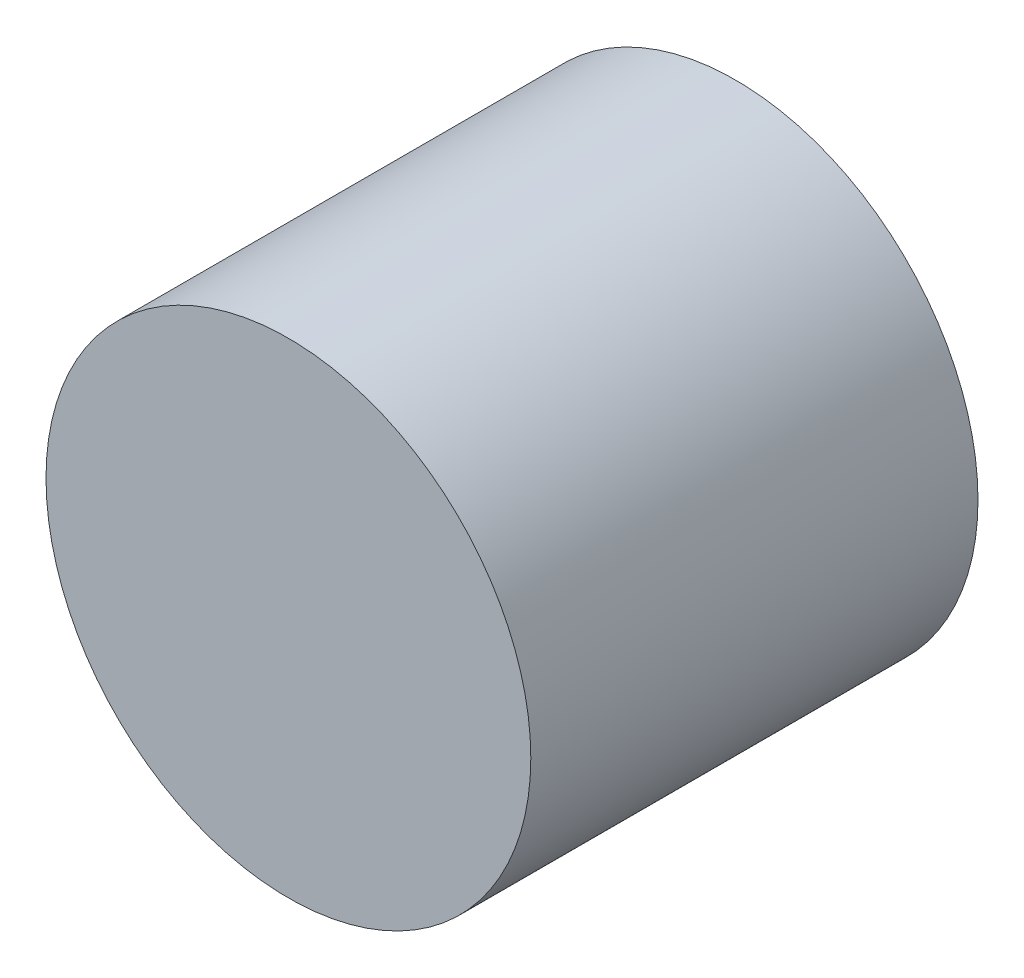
ISO-10303-21;
HEADER;
FILE_DESCRIPTION(('STEP AP214'),'2;1');
FILE_NAME('part.step','',(''),(''),'','','');
FILE_SCHEMA(('AUTOMOTIVE_DESIGN { 1 0 10303 214 1 1 1 1 }'));
ENDSEC;
DATA;
#1=APPLICATION_CONTEXT('core data for automotive mechanical design processes');
#2=APPLICATION_PROTOCOL_DEFINITION('international standard','automotive_design',2000,#1);
#3=PRODUCT_CONTEXT('',#1,'mechanical');
#4=PRODUCT('Part','Part','',(#3));
#5=PRODUCT_RELATED_PRODUCT_CATEGORY('part','',(#4));
#6=PRODUCT_DEFINITION_FORMATION('','',#4);
#7=PRODUCT_DEFINITION_CONTEXT('part definition',#1,'design');
#8=PRODUCT_DEFINITION('design','',#6,#7);
#9=PRODUCT_DEFINITION_SHAPE('','',#8);
#10=(LENGTH_UNIT() NAMED_UNIT(*) SI_UNIT(.MILLI.,.METRE.));
#11=(NAMED_UNIT(*) PLANE_ANGLE_UNIT() SI_UNIT($,.RADIAN.));
#12=(NAMED_UNIT(*) SI_UNIT($,.STERADIAN.) SOLID_ANGLE_UNIT());
#13=UNCERTAINTY_MEASURE_WITH_UNIT(LENGTH_MEASURE(1.E-05),#10,'distance_accuracy_value','');
#14=(GEOMETRIC_REPRESENTATION_CONTEXT(3) GLOBAL_UNCERTAINTY_ASSIGNED_CONTEXT((#13)) GLOBAL_UNIT_ASSIGNED_CONTEXT((#10,
#11,#12)) REPRESENTATION_CONTEXT('',''));
#15=CARTESIAN_POINT('',(0.,0.,0.));
#16=DIRECTION('',(0.,0.,1.));
#17=DIRECTION('',(1.,0.,0.));
#18=AXIS2_PLACEMENT_3D('',#15,#16,#17);
#19=CARTESIAN_POINT('',(0.,0.,59.));
#20=DIRECTION('',(0.,0.,-1.));
#21=DIRECTION('',(-1.,0.,0.));
#22=AXIS2_PLACEMENT_3D('',#19,#20,#21);
#23=CYLINDRICAL_SURFACE('',#22,31.9828734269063);
#24=CARTESIAN_POINT('',(0.,0.,59.));
#25=DIRECTION('',(0.,0.,1.));
#26=DIRECTION('',(1.,0.,0.));
#27=AXIS2_PLACEMENT_3D('',#24,#25,#26);
#28=CIRCLE('',#27,31.9828734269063);
#29=CARTESIAN_POINT('',(31.9828734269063,0.,59.));
#30=VERTEX_POINT('',#29);
#31=EDGE_CURVE('E10',#30,#30,#28,.T.);
#32=ORIENTED_EDGE('',*,*,#31,.F.);
#33=EDGE_LOOP('',(#32));
#34=FACE_BOUND('',#33,.T.);
#35=CARTESIAN_POINT('',(0.,0.,0.));
#36=DIRECTION('',(0.,0.,1.));
#37=DIRECTION('',(1.,0.,0.));
#38=AXIS2_PLACEMENT_3D('',#35,#36,#37);
#39=CIRCLE('',#38,31.9828734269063);
#40=CARTESIAN_POINT('',(31.9828734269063,0.,0.));
#41=VERTEX_POINT('',#40);
#42=EDGE_CURVE('E35',#41,#41,#39,.T.);
#43=ORIENTED_EDGE('',*,*,#42,.T.);
#44=EDGE_LOOP('',(#43));
#45=FACE_BOUND('',#44,.T.);
#46=ADVANCED_FACE('F32',(#34,#45),#23,.T.);
#47=CARTESIAN_POINT('',(0.,0.,59.));
#48=DIRECTION('',(0.,0.,1.));
#49=DIRECTION('',(1.,0.,0.));
#50=AXIS2_PLACEMENT_3D('',#47,#48,#49);
#51=PLANE('',#50);
#52=ORIENTED_EDGE('',*,*,#31,.T.);
#53=EDGE_LOOP('',(#52));
#54=FACE_BOUND('',#53,.T.);
#55=ADVANCED_FACE('F47',(#54),#51,.T.);
#56=CARTESIAN_POINT('',(0.,0.,0.));
#57=DIRECTION('',(0.,0.,1.));
#58=DIRECTION('',(1.,0.,0.));
#59=AXIS2_PLACEMENT_3D('',#56,#57,#58);
#60=PLANE('',#59);
#61=ORIENTED_EDGE('',*,*,#42,.F.);
#62=EDGE_LOOP('',(#61));
#63=FACE_BOUND('',#62,.T.);
#64=ADVANCED_FACE('F45',(#63),#60,.F.);
#65=CLOSED_SHELL('',(#46,#55,#64));
#66=MANIFOLD_SOLID_BREP('B2',#65);
#67=ADVANCED_BREP_SHAPE_REPRESENTATION('',(#18,#66),#14);
#68=SHAPE_DEFINITION_REPRESENTATION(#9,#67);
ENDSEC;
END-ISO-10303-21;
